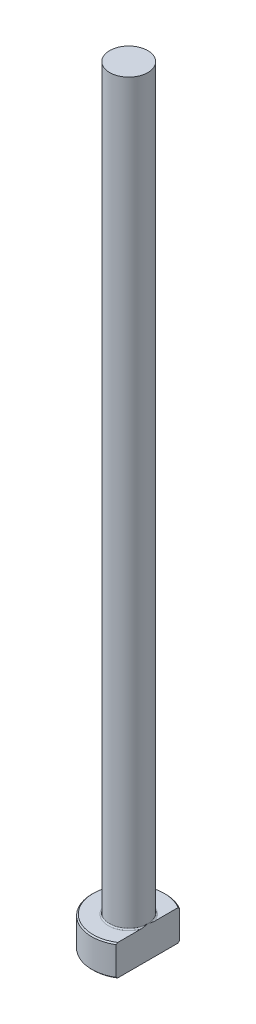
from build123d import *
from build123d.topology import SkipClean

# Parameters (mm, degrees)
CHAMFER1_SIZE = 0.2
FILLET1_R     = 0.2
KEY_DEPTH     = 126.287668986


with BuildPart() as part:
    # Sketch1 → Revolve1 (revolve)
    with BuildSketch(Plane.XY, mode=Mode.PRIVATE) as revolve1_sk:
        Polygon((0, 0), (-6, 0), (-6, 5), (-3.1, 5), (-3.1, 125), (0, 125), align=None)
    revolve(revolve1_sk.sketch.rotate(Axis((0, 259.958771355, 0), (0, -1, 0)), 270), axis=Axis((0, 259.958771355, 0), (0, -1, 0)))

    # Chamfer1
    chamfer1_edges = [part.edges().sort_by_distance(p)[0] for p in [
        (0, 5, -6),
        (0, 0, -6),
    ]]
    chamfer(chamfer1_edges, length=CHAMFER1_SIZE)

    # Fillet1
    fillet1_edges = [part.edges().sort_by_distance(p)[0] for p in [
        (0, 5, -3.1),
    ]]
    fillet(fillet1_edges, radius=FILLET1_R)

    # Sketch2 → KEY (cut, through all)
    with SkipClean():  # the faces are left unmerged after this step: merging them gives an invalid solid
        with BuildSketch(Plane(origin=(0, 0, 0), x_dir=(1, 0, 0), z_dir=(0, 1, 0))):
            with BuildLine():
                Line((3.1, 5.137119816), (3.1, -5.137119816))
                ThreePointArc((3.1, -5.137119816), (6, 0), (3.1, 5.137119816))
            make_face()
        extrude(amount=KEY_DEPTH, mode=Mode.SUBTRACT)


solid = part.part
